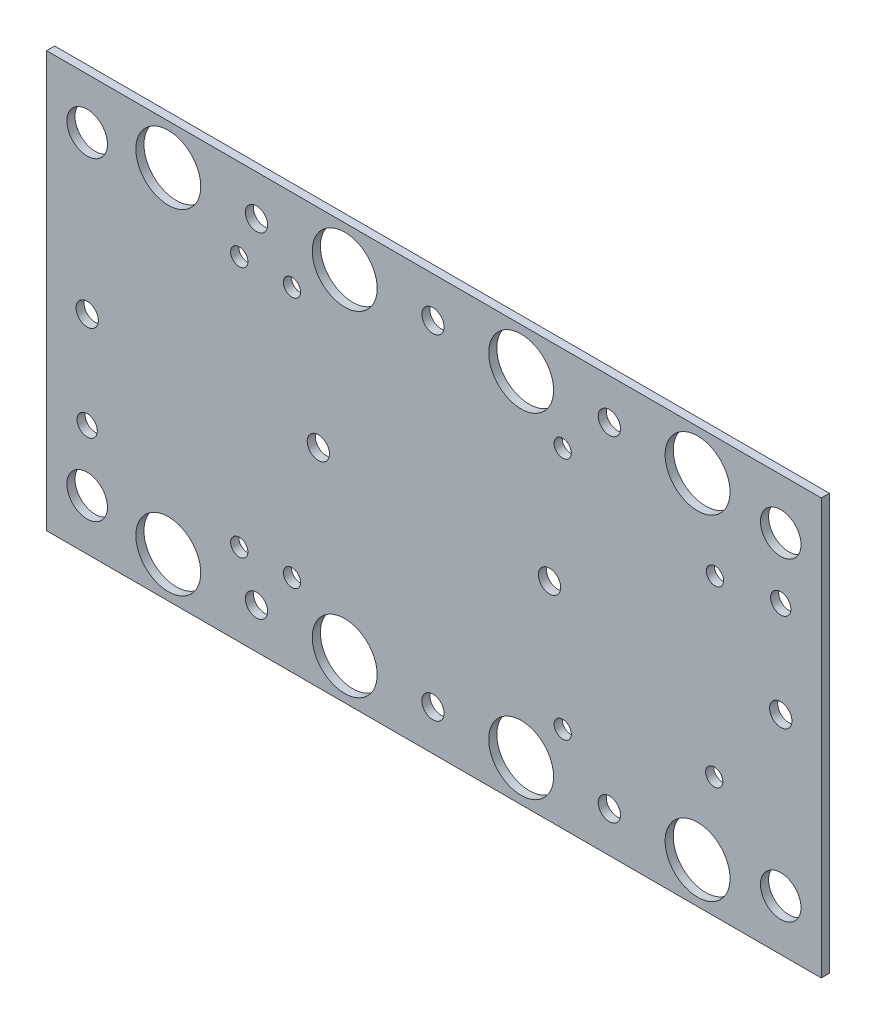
from build123d import *

# Parameters (mm, degrees)
ESQUISSE1_W             = 382
ESQUISSE1_H             = 205
ESQUISSE1_R             = 16
ESQUISSE1_R_2           = 10
BASE_EXTRUSION_DEPTH    = 4
ESQUISSE2_R             = 5.5
ENL_V_MAT_EXTRU_1_DEPTH = 488.078022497
ESQUISSE3_R             = 5
ENL_V_MAT_EXTRU_2_DEPTH = 488.078022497
ESQUISSE4_R             = 4.25
ENL_V_MAT_EXTRU_3_DEPTH = 488.078022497


with BuildPart() as part:
    # Esquisse1 → Base-Extrusion (new body)
    with BuildSketch(Plane.XY):
        with Locations((211, -172.5)):
            Rectangle(ESQUISSE1_W, ESQUISSE1_H)
        with Locations((341, -90)):
            Circle(ESQUISSE1_R, mode=Mode.SUBTRACT)
        with Locations((254, -90)):
            Circle(ESQUISSE1_R, mode=Mode.SUBTRACT)
        with Locations((167, -90)):
            Circle(ESQUISSE1_R, mode=Mode.SUBTRACT)
        with Locations((80, -90)):
            Circle(ESQUISSE1_R, mode=Mode.SUBTRACT)
        with Locations((382, -250)):
            Circle(ESQUISSE1_R_2, mode=Mode.SUBTRACT)
        with Locations((40, -250)):
            Circle(ESQUISSE1_R_2, mode=Mode.SUBTRACT)
        with Locations((40, -95)):
            Circle(ESQUISSE1_R_2, mode=Mode.SUBTRACT)
        with Locations((382, -95)):
            Circle(ESQUISSE1_R_2, mode=Mode.SUBTRACT)
        with Locations((341, -255)):
            Circle(ESQUISSE1_R, mode=Mode.SUBTRACT)
        with Locations((254, -255)):
            Circle(ESQUISSE1_R, mode=Mode.SUBTRACT)
        with Locations((167, -255)):
            Circle(ESQUISSE1_R, mode=Mode.SUBTRACT)
        with Locations((80, -255)):
            Circle(ESQUISSE1_R, mode=Mode.SUBTRACT)
    extrude(amount=BASE_EXTRUSION_DEPTH)

    # Esquisse2 → Enl_v. mat.-Extru.1 (cut, through all)
    with BuildSketch(Plane(origin=(0, 0, 0), x_dir=(-1, 0, 0), z_dir=(0, 0, -1))):
        with Locations((-297.5, -90)):
            Circle(ESQUISSE2_R)
        with Locations((-210.5, -90)):
            Circle(ESQUISSE2_R)
        with Locations((-123.5, -90)):
            Circle(ESQUISSE2_R)
        with Locations((-382, -172.5)):
            Circle(ESQUISSE2_R)
        with Locations((-268, -172.5)):
            Circle(ESQUISSE2_R)
        with Locations((-154, -172.5)):
            Circle(ESQUISSE2_R)
        with Locations((-40, -172.5)):
            Circle(ESQUISSE2_R)
        with Locations((-123.5, -255)):
            Circle(ESQUISSE2_R)
        with Locations((-210.5, -255)):
            Circle(ESQUISSE2_R)
        with Locations((-297.5, -255)):
            Circle(ESQUISSE2_R)
    extrude(amount=-ENL_V_MAT_EXTRU_1_DEPTH, mode=Mode.SUBTRACT)

    # Esquisse3 → Enl_v. mat.-Extru.2 (cut, through all)
    with BuildSketch(Plane.XY.offset(4)):
        with Locations((382, -125)):
            Circle(ESQUISSE3_R)
        with Locations((40, -220)):
            Circle(ESQUISSE3_R)
    extrude(amount=-ENL_V_MAT_EXTRU_2_DEPTH, mode=Mode.SUBTRACT)

    # Esquisse4 → Enl_v. mat.-Extru.3 (cut, through all)
    with BuildSketch(Plane(origin=(0, 0, 0), x_dir=(-1, 0, 0), z_dir=(0, 0, -1))):
        with Locations((-349.551704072, -129.5)):
            Circle(ESQUISSE4_R)
        with Locations((-349.213264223, -215.5)):
            Circle(ESQUISSE4_R)
        with Locations((-274.5, -112.5)):
            Circle(ESQUISSE4_R)
        with Locations((-274.5, -232.5)):
            Circle(ESQUISSE4_R)
        with Locations((-141, -110.5)):
            Circle(ESQUISSE4_R)
        with Locations((-115, -110.5)):
            Circle(ESQUISSE4_R)
        with Locations((-115, -234.5)):
            Circle(ESQUISSE4_R)
        with Locations((-141, -234.5)):
            Circle(ESQUISSE4_R)
    extrude(amount=-ENL_V_MAT_EXTRU_3_DEPTH, mode=Mode.SUBTRACT)


solid = part.part
